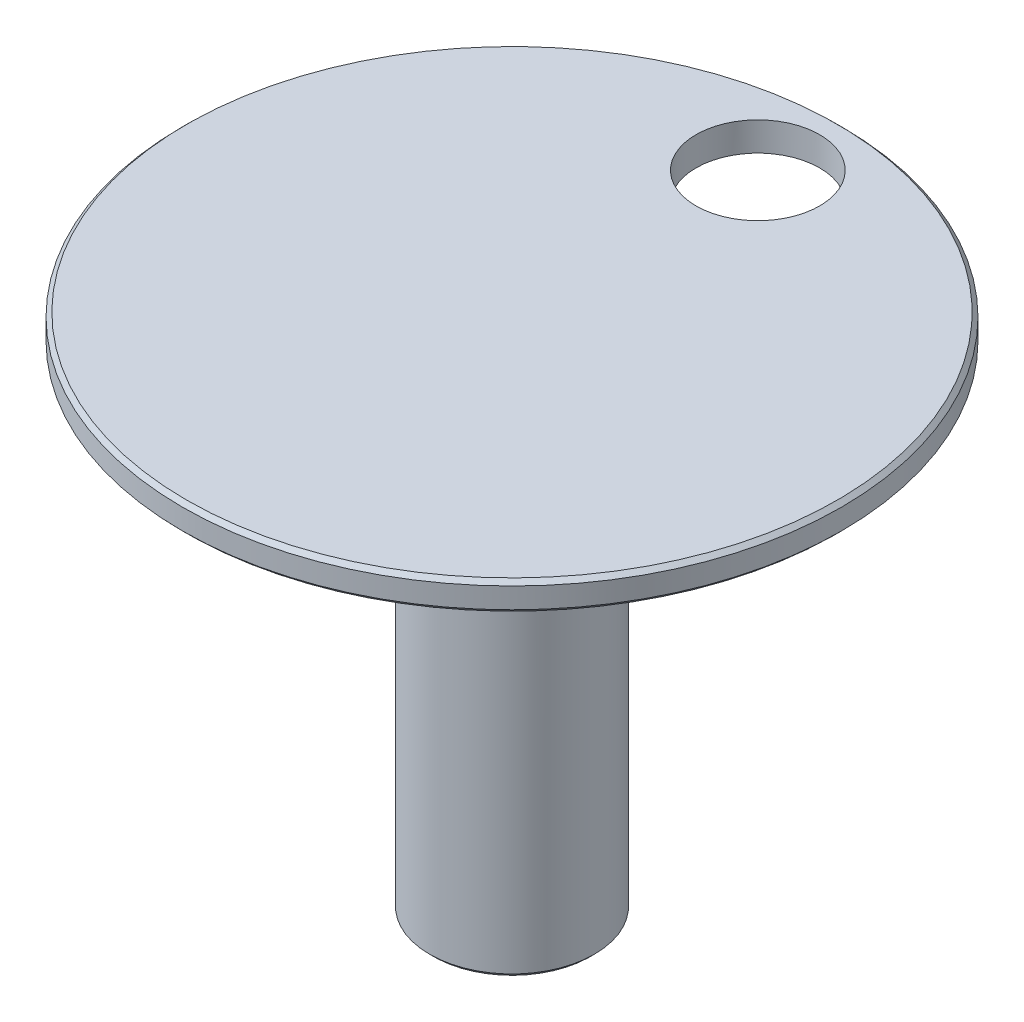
ISO-10303-21;
HEADER;
FILE_DESCRIPTION(('STEP AP214'),'2;1');
FILE_NAME('part.step','',(''),(''),'','','');
FILE_SCHEMA(('AUTOMOTIVE_DESIGN { 1 0 10303 214 1 1 1 1 }'));
ENDSEC;
DATA;
#1=APPLICATION_CONTEXT('core data for automotive mechanical design processes');
#2=APPLICATION_PROTOCOL_DEFINITION('international standard','automotive_design',2000,#1);
#3=PRODUCT_CONTEXT('',#1,'mechanical');
#4=PRODUCT('Part','Part','',(#3));
#5=PRODUCT_RELATED_PRODUCT_CATEGORY('part','',(#4));
#6=PRODUCT_DEFINITION_FORMATION('','',#4);
#7=PRODUCT_DEFINITION_CONTEXT('part definition',#1,'design');
#8=PRODUCT_DEFINITION('design','',#6,#7);
#9=PRODUCT_DEFINITION_SHAPE('','',#8);
#10=(LENGTH_UNIT() NAMED_UNIT(*) SI_UNIT(.MILLI.,.METRE.));
#11=(NAMED_UNIT(*) PLANE_ANGLE_UNIT() SI_UNIT($,.RADIAN.));
#12=(NAMED_UNIT(*) SI_UNIT($,.STERADIAN.) SOLID_ANGLE_UNIT());
#13=UNCERTAINTY_MEASURE_WITH_UNIT(LENGTH_MEASURE(1.E-05),#10,'distance_accuracy_value','');
#14=(GEOMETRIC_REPRESENTATION_CONTEXT(3) GLOBAL_UNCERTAINTY_ASSIGNED_CONTEXT((#13)) GLOBAL_UNIT_ASSIGNED_CONTEXT((#10,
#11,#12)) REPRESENTATION_CONTEXT('',''));
#15=CARTESIAN_POINT('',(0.,0.,0.));
#16=DIRECTION('',(0.,0.,1.));
#17=DIRECTION('',(1.,0.,0.));
#18=AXIS2_PLACEMENT_3D('',#15,#16,#17);
#19=CARTESIAN_POINT('',(0.,7.48633879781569,0.));
#20=DIRECTION('',(0.,1.,0.));
#21=DIRECTION('',(0.,0.,1.));
#22=AXIS2_PLACEMENT_3D('',#19,#20,#21);
#23=PLANE('',#22);
#24=CARTESIAN_POINT('',(0.,7.48633879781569,0.));
#25=DIRECTION('',(0.,1.,0.));
#26=DIRECTION('',(0.,0.,1.));
#27=AXIS2_PLACEMENT_3D('',#24,#25,#26);
#28=CIRCLE('',#27,7.89999999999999);
#29=CARTESIAN_POINT('',(0.,7.48633879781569,7.89999999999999));
#30=VERTEX_POINT('',#29);
#31=EDGE_CURVE('E10',#30,#30,#28,.T.);
#32=ORIENTED_EDGE('',*,*,#31,.T.);
#33=EDGE_LOOP('',(#32));
#34=FACE_BOUND('',#33,.T.);
#35=CARTESIAN_POINT('',(0.,7.48633879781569,-5.96875078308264));
#36=DIRECTION('',(0.,1.,0.));
#37=DIRECTION('',(0.,0.,1.));
#38=AXIS2_PLACEMENT_3D('',#35,#36,#37);
#39=CIRCLE('',#38,1.5);
#40=CARTESIAN_POINT('',(0.,7.48633879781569,-4.46875078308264));
#41=VERTEX_POINT('',#40);
#42=EDGE_CURVE('E65',#41,#41,#39,.T.);
#43=ORIENTED_EDGE('',*,*,#42,.F.);
#44=EDGE_LOOP('',(#43));
#45=FACE_BOUND('',#44,.T.);
#46=ADVANCED_FACE('F33',(#34,#45),#23,.T.);
#47=CARTESIAN_POINT('',(0.,0.,0.));
#48=DIRECTION('',(0.,1.,0.));
#49=DIRECTION('',(0.,0.,1.));
#50=AXIS2_PLACEMENT_3D('',#47,#48,#49);
#51=CYLINDRICAL_SURFACE('',#50,8.);
#52=CARTESIAN_POINT('',(0.,6.88633879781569,0.));
#53=DIRECTION('',(0.,-1.,0.));
#54=DIRECTION('',(0.,0.,-1.));
#55=AXIS2_PLACEMENT_3D('',#52,#53,#54);
#56=CIRCLE('',#55,8.);
#57=CARTESIAN_POINT('',(0.,6.88633879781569,-8.));
#58=VERTEX_POINT('',#57);
#59=EDGE_CURVE('E45',#58,#58,#56,.F.);
#60=ORIENTED_EDGE('',*,*,#59,.T.);
#61=EDGE_LOOP('',(#60));
#62=FACE_BOUND('',#61,.T.);
#63=CARTESIAN_POINT('',(0.,7.38633879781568,0.));
#64=DIRECTION('',(0.,1.,0.));
#65=DIRECTION('',(0.,0.,1.));
#66=AXIS2_PLACEMENT_3D('',#63,#64,#65);
#67=CIRCLE('',#66,8.);
#68=CARTESIAN_POINT('',(0.,7.38633879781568,8.));
#69=VERTEX_POINT('',#68);
#70=EDGE_CURVE('E49',#69,#69,#67,.F.);
#71=ORIENTED_EDGE('',*,*,#70,.T.);
#72=EDGE_LOOP('',(#71));
#73=FACE_BOUND('',#72,.T.);
#74=ADVANCED_FACE('F106',(#62,#73),#51,.T.);
#75=CARTESIAN_POINT('',(-8.,6.78633879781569,0.));
#76=DIRECTION('',(0.,-1.,0.));
#77=DIRECTION('',(0.,0.,-1.));
#78=AXIS2_PLACEMENT_3D('',#75,#76,#77);
#79=PLANE('',#78);
#80=CARTESIAN_POINT('',(0.,6.78633879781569,0.));
#81=DIRECTION('',(0.,-1.,0.));
#82=DIRECTION('',(0.,0.,-1.));
#83=AXIS2_PLACEMENT_3D('',#80,#81,#82);
#84=CIRCLE('',#83,7.9);
#85=CARTESIAN_POINT('',(0.,6.78633879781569,-7.9));
#86=VERTEX_POINT('',#85);
#87=EDGE_CURVE('E41',#86,#86,#84,.T.);
#88=ORIENTED_EDGE('',*,*,#87,.T.);
#89=EDGE_LOOP('',(#88));
#90=FACE_BOUND('',#89,.T.);
#91=CARTESIAN_POINT('',(0.,6.78633879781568,-5.96875078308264));
#92=DIRECTION('',(0.,-1.,0.));
#93=DIRECTION('',(0.,0.,-1.));
#94=AXIS2_PLACEMENT_3D('',#91,#92,#93);
#95=CIRCLE('',#94,1.5);
#96=CARTESIAN_POINT('',(0.,6.78633879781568,-7.46875078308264));
#97=VERTEX_POINT('',#96);
#98=EDGE_CURVE('E61',#97,#97,#95,.T.);
#99=ORIENTED_EDGE('',*,*,#98,.F.);
#100=EDGE_LOOP('',(#99));
#101=FACE_BOUND('',#100,.T.);
#102=CARTESIAN_POINT('',(0.,6.78633879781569,0.));
#103=DIRECTION('',(0.,1.,0.));
#104=DIRECTION('',(0.,0.,1.));
#105=AXIS2_PLACEMENT_3D('',#102,#103,#104);
#106=CIRCLE('',#105,4.);
#107=CARTESIAN_POINT('',(0.,6.78633879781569,4.));
#108=VERTEX_POINT('',#107);
#109=EDGE_CURVE('E60',#108,#108,#106,.T.);
#110=ORIENTED_EDGE('',*,*,#109,.T.);
#111=EDGE_LOOP('',(#110));
#112=FACE_BOUND('',#111,.T.);
#113=ADVANCED_FACE('F111',(#90,#101,#112),#79,.T.);
#114=CARTESIAN_POINT('',(0.,0.,0.));
#115=DIRECTION('',(0.,1.,0.));
#116=DIRECTION('',(0.,0.,1.));
#117=AXIS2_PLACEMENT_3D('',#114,#115,#116);
#118=CYLINDRICAL_SURFACE('',#117,4.);
#119=CARTESIAN_POINT('',(0.,6.48633879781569,0.));
#120=DIRECTION('',(0.,1.,0.));
#121=DIRECTION('',(0.,0.,1.));
#122=AXIS2_PLACEMENT_3D('',#119,#120,#121);
#123=CIRCLE('',#122,4.);
#124=CARTESIAN_POINT('',(0.,6.48633879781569,4.));
#125=VERTEX_POINT('',#124);
#126=EDGE_CURVE('E68',#125,#125,#123,.T.);
#127=ORIENTED_EDGE('',*,*,#126,.T.);
#128=EDGE_LOOP('',(#127));
#129=FACE_BOUND('',#128,.T.);
#130=ORIENTED_EDGE('',*,*,#109,.F.);
#131=EDGE_LOOP('',(#130));
#132=FACE_BOUND('',#131,.T.);
#133=ADVANCED_FACE('F174',(#129,#132),#118,.T.);
#134=CARTESIAN_POINT('',(-4.,6.48633879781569,0.));
#135=DIRECTION('',(0.,-1.,0.));
#136=DIRECTION('',(0.,0.,-1.));
#137=AXIS2_PLACEMENT_3D('',#134,#135,#136);
#138=PLANE('',#137);
#139=CARTESIAN_POINT('',(0.,6.48633879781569,0.));
#140=DIRECTION('',(0.,1.,0.));
#141=DIRECTION('',(0.,0.,1.));
#142=AXIS2_PLACEMENT_3D('',#139,#140,#141);
#143=CIRCLE('',#142,2.);
#144=CARTESIAN_POINT('',(0.,6.48633879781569,2.));
#145=VERTEX_POINT('',#144);
#146=EDGE_CURVE('E64',#145,#145,#143,.T.);
#147=ORIENTED_EDGE('',*,*,#146,.T.);
#148=EDGE_LOOP('',(#147));
#149=FACE_BOUND('',#148,.T.);
#150=ORIENTED_EDGE('',*,*,#126,.F.);
#151=EDGE_LOOP('',(#150));
#152=FACE_BOUND('',#151,.T.);
#153=ADVANCED_FACE('F102',(#149,#152),#138,.T.);
#154=CARTESIAN_POINT('',(0.,0.,0.));
#155=DIRECTION('',(0.,1.,0.));
#156=DIRECTION('',(0.,0.,1.));
#157=AXIS2_PLACEMENT_3D('',#154,#155,#156);
#158=CYLINDRICAL_SURFACE('',#157,2.);
#159=CARTESIAN_POINT('',(0.,-5.01366120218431,0.));
#160=DIRECTION('',(0.,-1.,0.));
#161=DIRECTION('',(0.,0.,-1.));
#162=AXIS2_PLACEMENT_3D('',#159,#160,#161);
#163=CIRCLE('',#162,2.);
#164=CARTESIAN_POINT('',(0.,-5.01366120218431,-2.));
#165=VERTEX_POINT('',#164);
#166=EDGE_CURVE('E57',#165,#165,#163,.F.);
#167=ORIENTED_EDGE('',*,*,#166,.T.);
#168=EDGE_LOOP('',(#167));
#169=FACE_BOUND('',#168,.T.);
#170=ORIENTED_EDGE('',*,*,#146,.F.);
#171=EDGE_LOOP('',(#170));
#172=FACE_BOUND('',#171,.T.);
#173=ADVANCED_FACE('F93',(#169,#172),#158,.T.);
#174=CARTESIAN_POINT('',(-2.,-5.11366120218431,0.));
#175=DIRECTION('',(0.,-1.,0.));
#176=DIRECTION('',(0.,0.,-1.));
#177=AXIS2_PLACEMENT_3D('',#174,#175,#176);
#178=PLANE('',#177);
#179=CARTESIAN_POINT('',(0.,-5.11366120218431,0.));
#180=DIRECTION('',(0.,-1.,0.));
#181=DIRECTION('',(0.,0.,-1.));
#182=AXIS2_PLACEMENT_3D('',#179,#180,#181);
#183=CIRCLE('',#182,1.9);
#184=CARTESIAN_POINT('',(0.,-5.11366120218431,-1.9));
#185=VERTEX_POINT('',#184);
#186=EDGE_CURVE('E54',#185,#185,#183,.T.);
#187=ORIENTED_EDGE('',*,*,#186,.T.);
#188=EDGE_LOOP('',(#187));
#189=FACE_BOUND('',#188,.T.);
#190=CARTESIAN_POINT('',(0.,-5.11366120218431,0.));
#191=DIRECTION('',(0.,-1.,0.));
#192=DIRECTION('',(0.,0.,-1.));
#193=AXIS2_PLACEMENT_3D('',#190,#191,#192);
#194=CIRCLE('',#193,1.5);
#195=CARTESIAN_POINT('',(0.,-5.11366120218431,-1.5));
#196=VERTEX_POINT('',#195);
#197=EDGE_CURVE('E76',#196,#196,#194,.T.);
#198=ORIENTED_EDGE('',*,*,#197,.F.);
#199=EDGE_LOOP('',(#198));
#200=FACE_BOUND('',#199,.T.);
#201=ADVANCED_FACE('F91',(#189,#200),#178,.T.);
#202=CARTESIAN_POINT('',(0.,-2.51366120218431,-5.96875078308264));
#203=DIRECTION('',(0.,1.,0.));
#204=DIRECTION('',(0.,0.,1.));
#205=AXIS2_PLACEMENT_3D('',#202,#203,#204);
#206=CYLINDRICAL_SURFACE('',#205,1.5);
#207=ORIENTED_EDGE('',*,*,#98,.T.);
#208=EDGE_LOOP('',(#207));
#209=FACE_BOUND('',#208,.T.);
#210=ORIENTED_EDGE('',*,*,#42,.T.);
#211=EDGE_LOOP('',(#210));
#212=FACE_BOUND('',#211,.T.);
#213=ADVANCED_FACE('F87',(#209,#212),#206,.F.);
#214=CARTESIAN_POINT('',(0.,3.38633879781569,0.));
#215=DIRECTION('',(0.,-1.,0.));
#216=DIRECTION('',(0.,0.,-1.));
#217=AXIS2_PLACEMENT_3D('',#214,#215,#216);
#218=CYLINDRICAL_SURFACE('',#217,1.5);
#219=CARTESIAN_POINT('',(0.,3.38633879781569,0.));
#220=DIRECTION('',(0.,-1.,0.));
#221=DIRECTION('',(0.,0.,-1.));
#222=AXIS2_PLACEMENT_3D('',#219,#220,#221);
#223=CIRCLE('',#222,1.5);
#224=CARTESIAN_POINT('',(0.,3.38633879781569,-1.5));
#225=VERTEX_POINT('',#224);
#226=EDGE_CURVE('E75',#225,#225,#223,.T.);
#227=ORIENTED_EDGE('',*,*,#226,.F.);
#228=EDGE_LOOP('',(#227));
#229=FACE_BOUND('',#228,.T.);
#230=ORIENTED_EDGE('',*,*,#197,.T.);
#231=EDGE_LOOP('',(#230));
#232=FACE_BOUND('',#231,.T.);
#233=ADVANCED_FACE('F84',(#229,#232),#218,.F.);
#234=CARTESIAN_POINT('',(0.,3.38633879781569,0.));
#235=DIRECTION('',(0.,-1.,0.));
#236=DIRECTION('',(0.,0.,-1.));
#237=AXIS2_PLACEMENT_3D('',#234,#235,#236);
#238=PLANE('',#237);
#239=ORIENTED_EDGE('',*,*,#226,.T.);
#240=EDGE_LOOP('',(#239));
#241=FACE_BOUND('',#240,.T.);
#242=ADVANCED_FACE('F82',(#241),#238,.T.);
#243=CARTESIAN_POINT('',(0.,-5.01366120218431,0.));
#244=DIRECTION('',(0.,1.,0.));
#245=DIRECTION('',(0.,0.,1.));
#246=AXIS2_PLACEMENT_3D('',#243,#244,#245);
#247=CONICAL_SURFACE('',#246,2.,0.78539816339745);
#248=ORIENTED_EDGE('',*,*,#186,.F.);
#249=EDGE_LOOP('',(#248));
#250=FACE_BOUND('',#249,.T.);
#251=ORIENTED_EDGE('',*,*,#166,.F.);
#252=EDGE_LOOP('',(#251));
#253=FACE_BOUND('',#252,.T.);
#254=ADVANCED_FACE('F118',(#250,#253),#247,.T.);
#255=CARTESIAN_POINT('',(0.,6.88633879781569,0.));
#256=DIRECTION('',(0.,1.,0.));
#257=DIRECTION('',(0.,0.,1.));
#258=AXIS2_PLACEMENT_3D('',#255,#256,#257);
#259=CONICAL_SURFACE('',#258,8.,0.78539816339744);
#260=ORIENTED_EDGE('',*,*,#87,.F.);
#261=EDGE_LOOP('',(#260));
#262=FACE_BOUND('',#261,.T.);
#263=ORIENTED_EDGE('',*,*,#59,.F.);
#264=EDGE_LOOP('',(#263));
#265=FACE_BOUND('',#264,.T.);
#266=ADVANCED_FACE('F123',(#262,#265),#259,.T.);
#267=CARTESIAN_POINT('',(0.,7.48633879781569,0.));
#268=DIRECTION('',(0.,-1.,0.));
#269=DIRECTION('',(0.,0.,-1.));
#270=AXIS2_PLACEMENT_3D('',#267,#268,#269);
#271=CONICAL_SURFACE('',#270,7.89999999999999,0.785398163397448);
#272=ORIENTED_EDGE('',*,*,#70,.F.);
#273=EDGE_LOOP('',(#272));
#274=FACE_BOUND('',#273,.T.);
#275=ORIENTED_EDGE('',*,*,#31,.F.);
#276=EDGE_LOOP('',(#275));
#277=FACE_BOUND('',#276,.T.);
#278=ADVANCED_FACE('F36',(#274,#277),#271,.T.);
#279=CLOSED_SHELL('',(#46,#74,#113,#133,#153,#173,#201,#213,#233,#242,#254,#266,#278));
#280=MANIFOLD_SOLID_BREP('B2',#279);
#281=ADVANCED_BREP_SHAPE_REPRESENTATION('',(#18,#280),#14);
#282=SHAPE_DEFINITION_REPRESENTATION(#9,#281);
ENDSEC;
END-ISO-10303-21;
